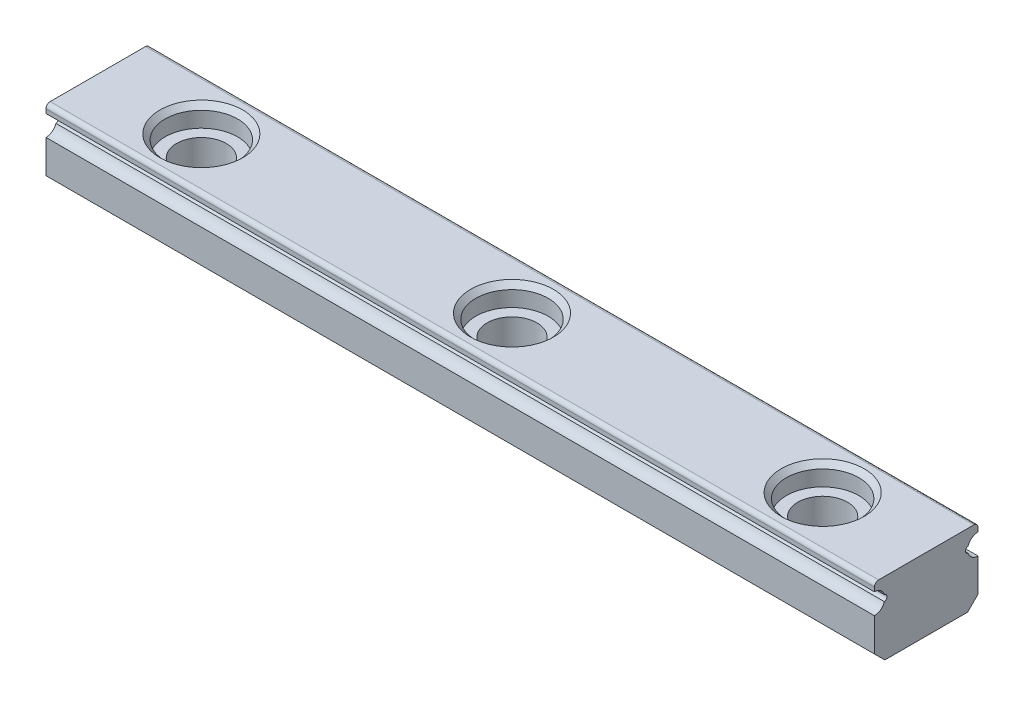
ISO-10303-21;
HEADER;
FILE_DESCRIPTION(('STEP AP214'),'2;1');
FILE_NAME('part.step','',(''),(''),'','','');
FILE_SCHEMA(('AUTOMOTIVE_DESIGN { 1 0 10303 214 1 1 1 1 }'));
ENDSEC;
DATA;
#1=APPLICATION_CONTEXT('core data for automotive mechanical design processes');
#2=APPLICATION_PROTOCOL_DEFINITION('international standard','automotive_design',2000,#1);
#3=PRODUCT_CONTEXT('',#1,'mechanical');
#4=PRODUCT('Part','Part','',(#3));
#5=PRODUCT_RELATED_PRODUCT_CATEGORY('part','',(#4));
#6=PRODUCT_DEFINITION_FORMATION('','',#4);
#7=PRODUCT_DEFINITION_CONTEXT('part definition',#1,'design');
#8=PRODUCT_DEFINITION('design','',#6,#7);
#9=PRODUCT_DEFINITION_SHAPE('','',#8);
#10=(LENGTH_UNIT() NAMED_UNIT(*) SI_UNIT(.MILLI.,.METRE.));
#11=(NAMED_UNIT(*) PLANE_ANGLE_UNIT() SI_UNIT($,.RADIAN.));
#12=(NAMED_UNIT(*) SI_UNIT($,.STERADIAN.) SOLID_ANGLE_UNIT());
#13=UNCERTAINTY_MEASURE_WITH_UNIT(LENGTH_MEASURE(1.E-05),#10,'distance_accuracy_value','');
#14=(GEOMETRIC_REPRESENTATION_CONTEXT(3) GLOBAL_UNCERTAINTY_ASSIGNED_CONTEXT((#13)) GLOBAL_UNIT_ASSIGNED_CONTEXT((#10,
#11,#12)) REPRESENTATION_CONTEXT('',''));
#15=CARTESIAN_POINT('',(0.,0.,0.));
#16=DIRECTION('',(0.,0.,1.));
#17=DIRECTION('',(1.,0.,0.));
#18=AXIS2_PLACEMENT_3D('',#15,#16,#17);
#19=CARTESIAN_POINT('',(-40.,0.499999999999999,2.5));
#20=DIRECTION('',(0.,0.,1.));
#21=DIRECTION('',(0.,-1.,0.));
#22=AXIS2_PLACEMENT_3D('',#19,#20,#21);
#23=PLANE('',#22);
#24=DIRECTION('',(1.,0.,0.));
#25=VECTOR('',#24,1.);
#26=CARTESIAN_POINT('',(-40.,2.09999999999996,2.5));
#27=LINE('',#26,#25);
#28=CARTESIAN_POINT('',(-40.,2.09999999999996,2.5));
#29=VERTEX_POINT('',#28);
#30=CARTESIAN_POINT('',(0.,2.09999999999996,2.5));
#31=VERTEX_POINT('',#30);
#32=EDGE_CURVE('E180',#29,#31,#27,.T.);
#33=ORIENTED_EDGE('',*,*,#32,.F.);
#34=DIRECTION('',(0.,-1.,0.));
#35=VECTOR('',#34,1.);
#36=CARTESIAN_POINT('',(-40.,0.499999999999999,2.5));
#37=LINE('',#36,#35);
#38=CARTESIAN_POINT('',(-40.,0.499999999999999,2.5));
#39=VERTEX_POINT('',#38);
#40=EDGE_CURVE('E168',#29,#39,#37,.T.);
#41=ORIENTED_EDGE('',*,*,#40,.T.);
#42=DIRECTION('',(1.,0.,0.));
#43=VECTOR('',#42,1.);
#44=CARTESIAN_POINT('',(-40.,0.499999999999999,2.5));
#45=LINE('',#44,#43);
#46=CARTESIAN_POINT('',(0.,0.499999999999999,2.5));
#47=VERTEX_POINT('',#46);
#48=EDGE_CURVE('E274',#39,#47,#45,.T.);
#49=ORIENTED_EDGE('',*,*,#48,.T.);
#50=DIRECTION('',(0.,-1.,0.));
#51=VECTOR('',#50,1.);
#52=CARTESIAN_POINT('',(0.,0.499999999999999,2.5));
#53=LINE('',#52,#51);
#54=EDGE_CURVE('E256',#31,#47,#53,.T.);
#55=ORIENTED_EDGE('',*,*,#54,.F.);
#56=EDGE_LOOP('',(#33,#41,#49,#55));
#57=FACE_BOUND('',#56,.T.);
#58=ADVANCED_FACE('F33',(#57),#23,.T.);
#59=CARTESIAN_POINT('',(-40.,0.5,-2.5));
#60=DIRECTION('',(0.,0.,-1.));
#61=DIRECTION('',(0.,1.,0.));
#62=AXIS2_PLACEMENT_3D('',#59,#60,#61);
#63=PLANE('',#62);
#64=DIRECTION('',(0.,1.,0.));
#65=VECTOR('',#64,1.);
#66=CARTESIAN_POINT('',(-40.,0.5,-2.5));
#67=LINE('',#66,#65);
#68=CARTESIAN_POINT('',(-40.,3.09999999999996,-2.5));
#69=VERTEX_POINT('',#68);
#70=CARTESIAN_POINT('',(-40.,3.3,-2.5));
#71=VERTEX_POINT('',#70);
#72=EDGE_CURVE('E268',#69,#71,#67,.T.);
#73=ORIENTED_EDGE('',*,*,#72,.T.);
#74=DIRECTION('',(1.,0.,0.));
#75=VECTOR('',#74,1.);
#76=CARTESIAN_POINT('',(-40.,3.3,-2.5));
#77=LINE('',#76,#75);
#78=CARTESIAN_POINT('',(0.,3.3,-2.5));
#79=VERTEX_POINT('',#78);
#80=EDGE_CURVE('E305',#71,#79,#77,.T.);
#81=ORIENTED_EDGE('',*,*,#80,.T.);
#82=DIRECTION('',(0.,1.,0.));
#83=VECTOR('',#82,1.);
#84=CARTESIAN_POINT('',(0.,0.5,-2.5));
#85=LINE('',#84,#83);
#86=CARTESIAN_POINT('',(0.,3.09999999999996,-2.5));
#87=VERTEX_POINT('',#86);
#88=EDGE_CURVE('E286',#87,#79,#85,.T.);
#89=ORIENTED_EDGE('',*,*,#88,.F.);
#90=DIRECTION('',(1.,0.,0.));
#91=VECTOR('',#90,1.);
#92=CARTESIAN_POINT('',(-40.,3.09999999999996,-2.5));
#93=LINE('',#92,#91);
#94=EDGE_CURVE('E200',#69,#87,#93,.T.);
#95=ORIENTED_EDGE('',*,*,#94,.F.);
#96=EDGE_LOOP('',(#73,#81,#89,#95));
#97=FACE_BOUND('',#96,.T.);
#98=ADVANCED_FACE('F326',(#97),#63,.T.);
#99=CARTESIAN_POINT('',(0.,3.3,2.5));
#100=VERTEX_POINT('',#99);
#101=CARTESIAN_POINT('',(0.,3.09999999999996,2.5));
#102=VERTEX_POINT('',#101);
#103=EDGE_CURVE('E275',#100,#102,#53,.T.);
#104=ORIENTED_EDGE('',*,*,#103,.F.);
#105=DIRECTION('',(1.,0.,0.));
#106=VECTOR('',#105,1.);
#107=CARTESIAN_POINT('',(-40.,3.3,2.5));
#108=LINE('',#107,#106);
#109=CARTESIAN_POINT('',(-40.,3.3,2.5));
#110=VERTEX_POINT('',#109);
#111=EDGE_CURVE('E11',#100,#110,#108,.F.);
#112=ORIENTED_EDGE('',*,*,#111,.T.);
#113=CARTESIAN_POINT('',(-40.,3.09999999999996,2.5));
#114=VERTEX_POINT('',#113);
#115=EDGE_CURVE('E257',#110,#114,#37,.T.);
#116=ORIENTED_EDGE('',*,*,#115,.T.);
#117=DIRECTION('',(1.,0.,0.));
#118=VECTOR('',#117,1.);
#119=CARTESIAN_POINT('',(-40.,3.09999999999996,2.5));
#120=LINE('',#119,#118);
#121=EDGE_CURVE('E176',#102,#114,#120,.F.);
#122=ORIENTED_EDGE('',*,*,#121,.F.);
#123=EDGE_LOOP('',(#104,#112,#116,#122));
#124=FACE_BOUND('',#123,.T.);
#125=ADVANCED_FACE('F340',(#124),#23,.T.);
#126=CARTESIAN_POINT('',(-40.,3.5,-2.5));
#127=DIRECTION('',(0.,1.,0.));
#128=DIRECTION('',(0.,0.,1.));
#129=AXIS2_PLACEMENT_3D('',#126,#127,#128);
#130=PLANE('',#129);
#131=CARTESIAN_POINT('',(-35.,3.5,0.));
#132=DIRECTION('',(0.,1.,0.));
#133=DIRECTION('',(0.,0.,1.));
#134=AXIS2_PLACEMENT_3D('',#131,#132,#133);
#135=CIRCLE('',#134,2.);
#136=CARTESIAN_POINT('',(-35.,3.5,2.));
#137=VERTEX_POINT('',#136);
#138=EDGE_CURVE('E202',#137,#137,#135,.T.);
#139=ORIENTED_EDGE('',*,*,#138,.F.);
#140=EDGE_LOOP('',(#139));
#141=FACE_BOUND('',#140,.T.);
#142=CARTESIAN_POINT('',(-20.,3.5,0.));
#143=DIRECTION('',(0.,1.,0.));
#144=DIRECTION('',(0.,0.,1.));
#145=AXIS2_PLACEMENT_3D('',#142,#143,#144);
#146=CIRCLE('',#145,2.);
#147=CARTESIAN_POINT('',(-20.,3.5,2.));
#148=VERTEX_POINT('',#147);
#149=EDGE_CURVE('E220',#148,#148,#146,.T.);
#150=ORIENTED_EDGE('',*,*,#149,.F.);
#151=EDGE_LOOP('',(#150));
#152=FACE_BOUND('',#151,.T.);
#153=CARTESIAN_POINT('',(-5.,3.5,0.));
#154=DIRECTION('',(0.,1.,0.));
#155=DIRECTION('',(0.,0.,1.));
#156=AXIS2_PLACEMENT_3D('',#153,#154,#155);
#157=CIRCLE('',#156,2.);
#158=CARTESIAN_POINT('',(-5.,3.5,2.));
#159=VERTEX_POINT('',#158);
#160=EDGE_CURVE('E238',#159,#159,#157,.T.);
#161=ORIENTED_EDGE('',*,*,#160,.F.);
#162=EDGE_LOOP('',(#161));
#163=FACE_BOUND('',#162,.T.);
#164=DIRECTION('',(0.,0.,1.));
#165=VECTOR('',#164,1.);
#166=CARTESIAN_POINT('',(0.,3.5,-2.5));
#167=LINE('',#166,#165);
#168=CARTESIAN_POINT('',(0.,3.5,-2.3));
#169=VERTEX_POINT('',#168);
#170=CARTESIAN_POINT('',(0.,3.5,2.3));
#171=VERTEX_POINT('',#170);
#172=EDGE_CURVE('E290',#169,#171,#167,.T.);
#173=ORIENTED_EDGE('',*,*,#172,.F.);
#174=DIRECTION('',(1.,0.,0.));
#175=VECTOR('',#174,1.);
#176=CARTESIAN_POINT('',(-40.,3.5,-2.3));
#177=LINE('',#176,#175);
#178=CARTESIAN_POINT('',(-40.,3.5,-2.3));
#179=VERTEX_POINT('',#178);
#180=EDGE_CURVE('E315',#169,#179,#177,.F.);
#181=ORIENTED_EDGE('',*,*,#180,.T.);
#182=DIRECTION('',(0.,0.,1.));
#183=VECTOR('',#182,1.);
#184=CARTESIAN_POINT('',(-40.,3.5,-2.5));
#185=LINE('',#184,#183);
#186=CARTESIAN_POINT('',(-40.,3.5,2.3));
#187=VERTEX_POINT('',#186);
#188=EDGE_CURVE('E272',#179,#187,#185,.T.);
#189=ORIENTED_EDGE('',*,*,#188,.T.);
#190=DIRECTION('',(1.,0.,0.));
#191=VECTOR('',#190,1.);
#192=CARTESIAN_POINT('',(-40.,3.5,2.3));
#193=LINE('',#192,#191);
#194=EDGE_CURVE('E312',#187,#171,#193,.T.);
#195=ORIENTED_EDGE('',*,*,#194,.T.);
#196=EDGE_LOOP('',(#173,#181,#189,#195));
#197=FACE_BOUND('',#196,.T.);
#198=ADVANCED_FACE('F335',(#141,#152,#163,#197),#130,.T.);
#199=DIRECTION('',(1.,0.,0.));
#200=VECTOR('',#199,1.);
#201=CARTESIAN_POINT('',(-40.,2.09999999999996,-2.5));
#202=LINE('',#201,#200);
#203=CARTESIAN_POINT('',(0.,2.09999999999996,-2.5));
#204=VERTEX_POINT('',#203);
#205=CARTESIAN_POINT('',(-40.,2.09999999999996,-2.5));
#206=VERTEX_POINT('',#205);
#207=EDGE_CURVE('E197',#204,#206,#202,.F.);
#208=ORIENTED_EDGE('',*,*,#207,.F.);
#209=CARTESIAN_POINT('',(0.,0.5,-2.5));
#210=VERTEX_POINT('',#209);
#211=EDGE_CURVE('E287',#210,#204,#85,.T.);
#212=ORIENTED_EDGE('',*,*,#211,.F.);
#213=DIRECTION('',(1.,0.,0.));
#214=VECTOR('',#213,1.);
#215=CARTESIAN_POINT('',(-40.,0.5,-2.5));
#216=LINE('',#215,#214);
#217=CARTESIAN_POINT('',(-40.,0.5,-2.5));
#218=VERTEX_POINT('',#217);
#219=EDGE_CURVE('E293',#218,#210,#216,.T.);
#220=ORIENTED_EDGE('',*,*,#219,.F.);
#221=EDGE_CURVE('E269',#218,#206,#67,.T.);
#222=ORIENTED_EDGE('',*,*,#221,.T.);
#223=EDGE_LOOP('',(#208,#212,#220,#222));
#224=FACE_BOUND('',#223,.T.);
#225=ADVANCED_FACE('F361',(#224),#63,.T.);
#226=CARTESIAN_POINT('',(-40.,0.,-2.));
#227=DIRECTION('',(0.,-0.707106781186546,-0.707106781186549));
#228=DIRECTION('',(0.,0.707106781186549,-0.707106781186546));
#229=AXIS2_PLACEMENT_3D('',#226,#227,#228);
#230=PLANE('',#229);
#231=DIRECTION('',(0.,0.707106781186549,-0.707106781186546));
#232=VECTOR('',#231,1.);
#233=CARTESIAN_POINT('',(0.,0.,-2.));
#234=LINE('',#233,#232);
#235=CARTESIAN_POINT('',(0.,0.,-2.));
#236=VERTEX_POINT('',#235);
#237=EDGE_CURVE('E283',#236,#210,#234,.T.);
#238=ORIENTED_EDGE('',*,*,#237,.F.);
#239=DIRECTION('',(1.,0.,0.));
#240=VECTOR('',#239,1.);
#241=CARTESIAN_POINT('',(-40.,0.,-2.));
#242=LINE('',#241,#240);
#243=CARTESIAN_POINT('',(-40.,0.,-2.));
#244=VERTEX_POINT('',#243);
#245=EDGE_CURVE('E296',#244,#236,#242,.T.);
#246=ORIENTED_EDGE('',*,*,#245,.F.);
#247=DIRECTION('',(0.,0.707106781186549,-0.707106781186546));
#248=VECTOR('',#247,1.);
#249=CARTESIAN_POINT('',(-40.,0.,-2.));
#250=LINE('',#249,#248);
#251=EDGE_CURVE('E265',#244,#218,#250,.T.);
#252=ORIENTED_EDGE('',*,*,#251,.T.);
#253=ORIENTED_EDGE('',*,*,#219,.T.);
#254=EDGE_LOOP('',(#238,#246,#252,#253));
#255=FACE_BOUND('',#254,.T.);
#256=ADVANCED_FACE('F356',(#255),#230,.T.);
#257=CARTESIAN_POINT('',(-40.,0.,-2.));
#258=DIRECTION('',(0.,-1.,0.));
#259=DIRECTION('',(0.,0.,-1.));
#260=AXIS2_PLACEMENT_3D('',#257,#258,#259);
#261=PLANE('',#260);
#262=CARTESIAN_POINT('',(-35.,0.,0.));
#263=DIRECTION('',(0.,1.,0.));
#264=DIRECTION('',(0.,0.,1.));
#265=AXIS2_PLACEMENT_3D('',#262,#263,#264);
#266=CIRCLE('',#265,1.4);
#267=CARTESIAN_POINT('',(-35.,0.,1.4));
#268=VERTEX_POINT('',#267);
#269=EDGE_CURVE('E217',#268,#268,#266,.T.);
#270=ORIENTED_EDGE('',*,*,#269,.T.);
#271=EDGE_LOOP('',(#270));
#272=FACE_BOUND('',#271,.T.);
#273=CARTESIAN_POINT('',(-20.,0.,0.));
#274=DIRECTION('',(0.,1.,0.));
#275=DIRECTION('',(0.,0.,1.));
#276=AXIS2_PLACEMENT_3D('',#273,#274,#275);
#277=CIRCLE('',#276,1.4);
#278=CARTESIAN_POINT('',(-20.,0.,1.4));
#279=VERTEX_POINT('',#278);
#280=EDGE_CURVE('E235',#279,#279,#277,.T.);
#281=ORIENTED_EDGE('',*,*,#280,.T.);
#282=EDGE_LOOP('',(#281));
#283=FACE_BOUND('',#282,.T.);
#284=CARTESIAN_POINT('',(-5.,0.,0.));
#285=DIRECTION('',(0.,1.,0.));
#286=DIRECTION('',(0.,0.,1.));
#287=AXIS2_PLACEMENT_3D('',#284,#285,#286);
#288=CIRCLE('',#287,1.4);
#289=CARTESIAN_POINT('',(-5.,0.,1.4));
#290=VERTEX_POINT('',#289);
#291=EDGE_CURVE('E253',#290,#290,#288,.T.);
#292=ORIENTED_EDGE('',*,*,#291,.T.);
#293=EDGE_LOOP('',(#292));
#294=FACE_BOUND('',#293,.T.);
#295=DIRECTION('',(0.,0.,-1.));
#296=VECTOR('',#295,1.);
#297=CARTESIAN_POINT('',(0.,0.,-2.));
#298=LINE('',#297,#296);
#299=CARTESIAN_POINT('',(0.,0.,2.));
#300=VERTEX_POINT('',#299);
#301=EDGE_CURVE('E280',#300,#236,#298,.T.);
#302=ORIENTED_EDGE('',*,*,#301,.F.);
#303=DIRECTION('',(1.,0.,0.));
#304=VECTOR('',#303,1.);
#305=CARTESIAN_POINT('',(-40.,0.,2.));
#306=LINE('',#305,#304);
#307=CARTESIAN_POINT('',(-40.,0.,2.));
#308=VERTEX_POINT('',#307);
#309=EDGE_CURVE('E298',#308,#300,#306,.T.);
#310=ORIENTED_EDGE('',*,*,#309,.F.);
#311=DIRECTION('',(0.,0.,-1.));
#312=VECTOR('',#311,1.);
#313=CARTESIAN_POINT('',(-40.,0.,-2.));
#314=LINE('',#313,#312);
#315=EDGE_CURVE('E262',#308,#244,#314,.T.);
#316=ORIENTED_EDGE('',*,*,#315,.T.);
#317=ORIENTED_EDGE('',*,*,#245,.T.);
#318=EDGE_LOOP('',(#302,#310,#316,#317));
#319=FACE_BOUND('',#318,.T.);
#320=ADVANCED_FACE('F352',(#272,#283,#294,#319),#261,.T.);
#321=CARTESIAN_POINT('',(-40.,0.,2.));
#322=DIRECTION('',(0.,-0.707106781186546,0.707106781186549));
#323=DIRECTION('',(0.,-0.707106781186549,-0.707106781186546));
#324=AXIS2_PLACEMENT_3D('',#321,#322,#323);
#325=PLANE('',#324);
#326=DIRECTION('',(0.,-0.707106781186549,-0.707106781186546));
#327=VECTOR('',#326,1.);
#328=CARTESIAN_POINT('',(0.,0.,2.));
#329=LINE('',#328,#327);
#330=EDGE_CURVE('E277',#47,#300,#329,.T.);
#331=ORIENTED_EDGE('',*,*,#330,.F.);
#332=ORIENTED_EDGE('',*,*,#48,.F.);
#333=DIRECTION('',(0.,-0.707106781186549,-0.707106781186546));
#334=VECTOR('',#333,1.);
#335=CARTESIAN_POINT('',(-40.,0.,2.));
#336=LINE('',#335,#334);
#337=EDGE_CURVE('E259',#39,#308,#336,.T.);
#338=ORIENTED_EDGE('',*,*,#337,.T.);
#339=ORIENTED_EDGE('',*,*,#309,.T.);
#340=EDGE_LOOP('',(#331,#332,#338,#339));
#341=FACE_BOUND('',#340,.T.);
#342=ADVANCED_FACE('F348',(#341),#325,.T.);
#343=CARTESIAN_POINT('',(-40.,3.5,2.5));
#344=DIRECTION('',(1.,0.,0.));
#345=DIRECTION('',(0.,0.,-1.));
#346=AXIS2_PLACEMENT_3D('',#343,#344,#345);
#347=PLANE('',#346);
#348=ORIENTED_EDGE('',*,*,#188,.F.);
#349=CARTESIAN_POINT('',(-40.,3.3,-2.3));
#350=DIRECTION('',(1.,0.,0.));
#351=DIRECTION('',(0.,0.,-1.));
#352=AXIS2_PLACEMENT_3D('',#349,#350,#351);
#353=CIRCLE('',#352,0.2);
#354=EDGE_CURVE('E41',#179,#71,#353,.F.);
#355=ORIENTED_EDGE('',*,*,#354,.T.);
#356=ORIENTED_EDGE('',*,*,#72,.F.);
#357=CARTESIAN_POINT('',(-40.,2.59999999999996,-2.5));
#358=DIRECTION('',(1.,0.,0.));
#359=DIRECTION('',(0.,0.,-1.));
#360=AXIS2_PLACEMENT_3D('',#357,#358,#359);
#361=CIRCLE('',#360,0.5);
#362=CARTESIAN_POINT('',(-40.,2.74825255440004,-2.02248436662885));
#363=VERTEX_POINT('',#362);
#364=EDGE_CURVE('E187',#69,#363,#361,.T.);
#365=ORIENTED_EDGE('',*,*,#364,.T.);
#366=CARTESIAN_POINT('',(-40.,2.59999999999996,-2.04531373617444));
#367=DIRECTION('',(1.,0.,0.));
#368=DIRECTION('',(0.,0.,-1.));
#369=AXIS2_PLACEMENT_3D('',#366,#367,#368);
#370=CIRCLE('',#369,0.15);
#371=CARTESIAN_POINT('',(-40.,2.45174744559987,-2.02248436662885));
#372=VERTEX_POINT('',#371);
#373=EDGE_CURVE('E186',#363,#372,#370,.T.);
#374=ORIENTED_EDGE('',*,*,#373,.T.);
#375=EDGE_CURVE('E183',#372,#206,#361,.T.);
#376=ORIENTED_EDGE('',*,*,#375,.T.);
#377=ORIENTED_EDGE('',*,*,#221,.F.);
#378=ORIENTED_EDGE('',*,*,#251,.F.);
#379=ORIENTED_EDGE('',*,*,#315,.F.);
#380=ORIENTED_EDGE('',*,*,#337,.F.);
#381=ORIENTED_EDGE('',*,*,#40,.F.);
#382=CARTESIAN_POINT('',(-40.,2.59999999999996,2.5));
#383=DIRECTION('',(1.,0.,0.));
#384=DIRECTION('',(0.,0.,1.));
#385=AXIS2_PLACEMENT_3D('',#382,#383,#384);
#386=CIRCLE('',#385,0.5);
#387=CARTESIAN_POINT('',(-40.,2.45174744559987,2.02248436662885));
#388=VERTEX_POINT('',#387);
#389=EDGE_CURVE('E149',#29,#388,#386,.T.);
#390=ORIENTED_EDGE('',*,*,#389,.T.);
#391=CARTESIAN_POINT('',(-40.,2.59999999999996,2.04531373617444));
#392=DIRECTION('',(1.,0.,0.));
#393=DIRECTION('',(0.,0.,1.));
#394=AXIS2_PLACEMENT_3D('',#391,#392,#393);
#395=CIRCLE('',#394,0.15);
#396=CARTESIAN_POINT('',(-40.,2.74825255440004,2.02248436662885));
#397=VERTEX_POINT('',#396);
#398=EDGE_CURVE('E157',#388,#397,#395,.T.);
#399=ORIENTED_EDGE('',*,*,#398,.T.);
#400=EDGE_CURVE('E163',#397,#114,#386,.T.);
#401=ORIENTED_EDGE('',*,*,#400,.T.);
#402=ORIENTED_EDGE('',*,*,#115,.F.);
#403=CARTESIAN_POINT('',(-40.,3.3,2.3));
#404=DIRECTION('',(1.,0.,0.));
#405=DIRECTION('',(0.,0.,-1.));
#406=AXIS2_PLACEMENT_3D('',#403,#404,#405);
#407=CIRCLE('',#406,0.2);
#408=EDGE_CURVE('E53',#110,#187,#407,.F.);
#409=ORIENTED_EDGE('',*,*,#408,.T.);
#410=EDGE_LOOP('',(#348,#355,#356,#365,#374,#376,#377,#378,#379,#380,#381,#390,#399,#401,#402,#409));
#411=FACE_BOUND('',#410,.T.);
#412=ADVANCED_FACE('F166',(#411),#347,.F.);
#413=CARTESIAN_POINT('',(0.,3.5,2.5));
#414=DIRECTION('',(1.,0.,0.));
#415=DIRECTION('',(0.,0.,-1.));
#416=AXIS2_PLACEMENT_3D('',#413,#414,#415);
#417=PLANE('',#416);
#418=ORIENTED_EDGE('',*,*,#88,.T.);
#419=CARTESIAN_POINT('',(0.,3.3,-2.3));
#420=DIRECTION('',(1.,0.,0.));
#421=DIRECTION('',(0.,0.,-1.));
#422=AXIS2_PLACEMENT_3D('',#419,#420,#421);
#423=CIRCLE('',#422,0.2);
#424=EDGE_CURVE('E310',#79,#169,#423,.T.);
#425=ORIENTED_EDGE('',*,*,#424,.T.);
#426=ORIENTED_EDGE('',*,*,#172,.T.);
#427=CARTESIAN_POINT('',(0.,3.3,2.3));
#428=DIRECTION('',(1.,0.,0.));
#429=DIRECTION('',(0.,0.,-1.));
#430=AXIS2_PLACEMENT_3D('',#427,#428,#429);
#431=CIRCLE('',#430,0.2);
#432=EDGE_CURVE('E308',#171,#100,#431,.T.);
#433=ORIENTED_EDGE('',*,*,#432,.T.);
#434=ORIENTED_EDGE('',*,*,#103,.T.);
#435=CARTESIAN_POINT('',(0.,2.59999999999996,2.5));
#436=DIRECTION('',(1.,0.,0.));
#437=DIRECTION('',(0.,0.,1.));
#438=AXIS2_PLACEMENT_3D('',#435,#436,#437);
#439=CIRCLE('',#438,0.5);
#440=CARTESIAN_POINT('',(0.,2.74825255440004,2.02248436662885));
#441=VERTEX_POINT('',#440);
#442=EDGE_CURVE('E171',#441,#102,#439,.T.);
#443=ORIENTED_EDGE('',*,*,#442,.F.);
#444=CARTESIAN_POINT('',(0.,2.59999999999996,2.04531373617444));
#445=DIRECTION('',(1.,0.,0.));
#446=DIRECTION('',(0.,0.,1.));
#447=AXIS2_PLACEMENT_3D('',#444,#445,#446);
#448=CIRCLE('',#447,0.15);
#449=CARTESIAN_POINT('',(0.,2.45174744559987,2.02248436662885));
#450=VERTEX_POINT('',#449);
#451=EDGE_CURVE('E169',#450,#441,#448,.T.);
#452=ORIENTED_EDGE('',*,*,#451,.F.);
#453=CARTESIAN_POINT('',(0.,2.59999999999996,2.5));
#454=DIRECTION('',(1.,0.,0.));
#455=DIRECTION('',(0.,0.,-1.));
#456=AXIS2_PLACEMENT_3D('',#453,#454,#455);
#457=CIRCLE('',#456,0.5);
#458=EDGE_CURVE('E152',#31,#450,#457,.T.);
#459=ORIENTED_EDGE('',*,*,#458,.F.);
#460=ORIENTED_EDGE('',*,*,#54,.T.);
#461=ORIENTED_EDGE('',*,*,#330,.T.);
#462=ORIENTED_EDGE('',*,*,#301,.T.);
#463=ORIENTED_EDGE('',*,*,#237,.T.);
#464=ORIENTED_EDGE('',*,*,#211,.T.);
#465=CARTESIAN_POINT('',(0.,2.59999999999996,-2.5));
#466=DIRECTION('',(1.,0.,0.));
#467=DIRECTION('',(0.,0.,-1.));
#468=AXIS2_PLACEMENT_3D('',#465,#466,#467);
#469=CIRCLE('',#468,0.5);
#470=CARTESIAN_POINT('',(0.,2.45174744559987,-2.02248436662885));
#471=VERTEX_POINT('',#470);
#472=EDGE_CURVE('E182',#471,#204,#469,.T.);
#473=ORIENTED_EDGE('',*,*,#472,.F.);
#474=CARTESIAN_POINT('',(0.,2.59999999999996,-2.04531373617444));
#475=DIRECTION('',(1.,0.,0.));
#476=DIRECTION('',(0.,0.,-1.));
#477=AXIS2_PLACEMENT_3D('',#474,#475,#476);
#478=CIRCLE('',#477,0.15);
#479=CARTESIAN_POINT('',(0.,2.74825255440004,-2.02248436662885));
#480=VERTEX_POINT('',#479);
#481=EDGE_CURVE('E192',#480,#471,#478,.T.);
#482=ORIENTED_EDGE('',*,*,#481,.F.);
#483=CARTESIAN_POINT('',(0.,2.59999999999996,-2.5));
#484=DIRECTION('',(1.,0.,0.));
#485=DIRECTION('',(0.,0.,-1.));
#486=AXIS2_PLACEMENT_3D('',#483,#484,#485);
#487=CIRCLE('',#486,0.5);
#488=EDGE_CURVE('E295',#87,#480,#487,.T.);
#489=ORIENTED_EDGE('',*,*,#488,.F.);
#490=EDGE_LOOP('',(#418,#425,#426,#433,#434,#443,#452,#459,#460,#461,#462,#463,#464,#473,#482,#489));
#491=FACE_BOUND('',#490,.T.);
#492=ADVANCED_FACE('F332',(#491),#417,.T.);
#493=CARTESIAN_POINT('',(-5.,0.2,0.));
#494=DIRECTION('',(0.,-1.,0.));
#495=DIRECTION('',(0.,0.,-1.));
#496=AXIS2_PLACEMENT_3D('',#493,#494,#495);
#497=CONICAL_SURFACE('',#496,1.2,0.785398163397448);
#498=ORIENTED_EDGE('',*,*,#291,.F.);
#499=EDGE_LOOP('',(#498));
#500=FACE_BOUND('',#499,.T.);
#501=CARTESIAN_POINT('',(-5.,0.2,0.));
#502=DIRECTION('',(0.,1.,0.));
#503=DIRECTION('',(0.,0.,1.));
#504=AXIS2_PLACEMENT_3D('',#501,#502,#503);
#505=CIRCLE('',#504,1.2);
#506=CARTESIAN_POINT('',(-5.,0.2,1.2));
#507=VERTEX_POINT('',#506);
#508=EDGE_CURVE('E250',#507,#507,#505,.T.);
#509=ORIENTED_EDGE('',*,*,#508,.T.);
#510=EDGE_LOOP('',(#509));
#511=FACE_BOUND('',#510,.T.);
#512=ADVANCED_FACE('F415',(#500,#511),#497,.F.);
#513=CARTESIAN_POINT('',(-5.,3.5,0.));
#514=DIRECTION('',(0.,1.,0.));
#515=DIRECTION('',(0.,0.,1.));
#516=AXIS2_PLACEMENT_3D('',#513,#514,#515);
#517=CYLINDRICAL_SURFACE('',#516,1.2);
#518=ORIENTED_EDGE('',*,*,#508,.F.);
#519=EDGE_LOOP('',(#518));
#520=FACE_BOUND('',#519,.T.);
#521=CARTESIAN_POINT('',(-5.,2.5,0.));
#522=DIRECTION('',(0.,1.,0.));
#523=DIRECTION('',(0.,0.,1.));
#524=AXIS2_PLACEMENT_3D('',#521,#522,#523);
#525=CIRCLE('',#524,1.2);
#526=CARTESIAN_POINT('',(-5.,2.5,1.2));
#527=VERTEX_POINT('',#526);
#528=EDGE_CURVE('E247',#527,#527,#525,.T.);
#529=ORIENTED_EDGE('',*,*,#528,.T.);
#530=EDGE_LOOP('',(#529));
#531=FACE_BOUND('',#530,.T.);
#532=ADVANCED_FACE('F419',(#520,#531),#517,.F.);
#533=CARTESIAN_POINT('',(-3.25,2.5,0.));
#534=DIRECTION('',(0.,-1.,0.));
#535=DIRECTION('',(0.,0.,-1.));
#536=AXIS2_PLACEMENT_3D('',#533,#534,#535);
#537=PLANE('',#536);
#538=ORIENTED_EDGE('',*,*,#528,.F.);
#539=EDGE_LOOP('',(#538));
#540=FACE_BOUND('',#539,.T.);
#541=CARTESIAN_POINT('',(-5.,2.5,0.));
#542=DIRECTION('',(0.,1.,0.));
#543=DIRECTION('',(0.,0.,1.));
#544=AXIS2_PLACEMENT_3D('',#541,#542,#543);
#545=CIRCLE('',#544,1.75);
#546=CARTESIAN_POINT('',(-5.,2.5,1.75));
#547=VERTEX_POINT('',#546);
#548=EDGE_CURVE('E244',#547,#547,#545,.T.);
#549=ORIENTED_EDGE('',*,*,#548,.T.);
#550=EDGE_LOOP('',(#549));
#551=FACE_BOUND('',#550,.T.);
#552=ADVANCED_FACE('F423',(#540,#551),#537,.F.);
#553=CARTESIAN_POINT('',(-5.,3.5,0.));
#554=DIRECTION('',(0.,1.,0.));
#555=DIRECTION('',(0.,0.,1.));
#556=AXIS2_PLACEMENT_3D('',#553,#554,#555);
#557=CYLINDRICAL_SURFACE('',#556,1.75);
#558=ORIENTED_EDGE('',*,*,#548,.F.);
#559=EDGE_LOOP('',(#558));
#560=FACE_BOUND('',#559,.T.);
#561=CARTESIAN_POINT('',(-5.,3.25,0.));
#562=DIRECTION('',(0.,1.,0.));
#563=DIRECTION('',(0.,0.,1.));
#564=AXIS2_PLACEMENT_3D('',#561,#562,#563);
#565=CIRCLE('',#564,1.75);
#566=CARTESIAN_POINT('',(-5.,3.25,1.75));
#567=VERTEX_POINT('',#566);
#568=EDGE_CURVE('E241',#567,#567,#565,.T.);
#569=ORIENTED_EDGE('',*,*,#568,.T.);
#570=EDGE_LOOP('',(#569));
#571=FACE_BOUND('',#570,.T.);
#572=ADVANCED_FACE('F427',(#560,#571),#557,.F.);
#573=CARTESIAN_POINT('',(-5.,3.5,0.));
#574=DIRECTION('',(0.,1.,0.));
#575=DIRECTION('',(0.,0.,1.));
#576=AXIS2_PLACEMENT_3D('',#573,#574,#575);
#577=CONICAL_SURFACE('',#576,2.,0.785398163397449);
#578=ORIENTED_EDGE('',*,*,#568,.F.);
#579=EDGE_LOOP('',(#578));
#580=FACE_BOUND('',#579,.T.);
#581=ORIENTED_EDGE('',*,*,#160,.T.);
#582=EDGE_LOOP('',(#581));
#583=FACE_BOUND('',#582,.T.);
#584=ADVANCED_FACE('F431',(#580,#583),#577,.F.);
#585=CARTESIAN_POINT('',(-20.,0.2,0.));
#586=DIRECTION('',(0.,-1.,0.));
#587=DIRECTION('',(0.,0.,-1.));
#588=AXIS2_PLACEMENT_3D('',#585,#586,#587);
#589=CONICAL_SURFACE('',#588,1.2,0.785398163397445);
#590=ORIENTED_EDGE('',*,*,#280,.F.);
#591=EDGE_LOOP('',(#590));
#592=FACE_BOUND('',#591,.T.);
#593=CARTESIAN_POINT('',(-20.,0.2,0.));
#594=DIRECTION('',(0.,1.,0.));
#595=DIRECTION('',(0.,0.,1.));
#596=AXIS2_PLACEMENT_3D('',#593,#594,#595);
#597=CIRCLE('',#596,1.2);
#598=CARTESIAN_POINT('',(-20.,0.2,1.2));
#599=VERTEX_POINT('',#598);
#600=EDGE_CURVE('E232',#599,#599,#597,.T.);
#601=ORIENTED_EDGE('',*,*,#600,.T.);
#602=EDGE_LOOP('',(#601));
#603=FACE_BOUND('',#602,.T.);
#604=ADVANCED_FACE('F435',(#592,#603),#589,.F.);
#605=CARTESIAN_POINT('',(-20.,3.5,0.));
#606=DIRECTION('',(0.,1.,0.));
#607=DIRECTION('',(0.,0.,1.));
#608=AXIS2_PLACEMENT_3D('',#605,#606,#607);
#609=CYLINDRICAL_SURFACE('',#608,1.2);
#610=ORIENTED_EDGE('',*,*,#600,.F.);
#611=EDGE_LOOP('',(#610));
#612=FACE_BOUND('',#611,.T.);
#613=CARTESIAN_POINT('',(-20.,2.5,0.));
#614=DIRECTION('',(0.,1.,0.));
#615=DIRECTION('',(0.,0.,1.));
#616=AXIS2_PLACEMENT_3D('',#613,#614,#615);
#617=CIRCLE('',#616,1.2);
#618=CARTESIAN_POINT('',(-20.,2.5,1.2));
#619=VERTEX_POINT('',#618);
#620=EDGE_CURVE('E229',#619,#619,#617,.T.);
#621=ORIENTED_EDGE('',*,*,#620,.T.);
#622=EDGE_LOOP('',(#621));
#623=FACE_BOUND('',#622,.T.);
#624=ADVANCED_FACE('F439',(#612,#623),#609,.F.);
#625=CARTESIAN_POINT('',(-18.25,2.5,0.));
#626=DIRECTION('',(0.,-1.,0.));
#627=DIRECTION('',(0.,0.,-1.));
#628=AXIS2_PLACEMENT_3D('',#625,#626,#627);
#629=PLANE('',#628);
#630=ORIENTED_EDGE('',*,*,#620,.F.);
#631=EDGE_LOOP('',(#630));
#632=FACE_BOUND('',#631,.T.);
#633=CARTESIAN_POINT('',(-20.,2.5,0.));
#634=DIRECTION('',(0.,1.,0.));
#635=DIRECTION('',(0.,0.,1.));
#636=AXIS2_PLACEMENT_3D('',#633,#634,#635);
#637=CIRCLE('',#636,1.75);
#638=CARTESIAN_POINT('',(-20.,2.5,1.75));
#639=VERTEX_POINT('',#638);
#640=EDGE_CURVE('E226',#639,#639,#637,.T.);
#641=ORIENTED_EDGE('',*,*,#640,.T.);
#642=EDGE_LOOP('',(#641));
#643=FACE_BOUND('',#642,.T.);
#644=ADVANCED_FACE('F443',(#632,#643),#629,.F.);
#645=CARTESIAN_POINT('',(-20.,3.5,0.));
#646=DIRECTION('',(0.,1.,0.));
#647=DIRECTION('',(0.,0.,1.));
#648=AXIS2_PLACEMENT_3D('',#645,#646,#647);
#649=CYLINDRICAL_SURFACE('',#648,1.75);
#650=ORIENTED_EDGE('',*,*,#640,.F.);
#651=EDGE_LOOP('',(#650));
#652=FACE_BOUND('',#651,.T.);
#653=CARTESIAN_POINT('',(-20.,3.25,0.));
#654=DIRECTION('',(0.,1.,0.));
#655=DIRECTION('',(0.,0.,1.));
#656=AXIS2_PLACEMENT_3D('',#653,#654,#655);
#657=CIRCLE('',#656,1.75);
#658=CARTESIAN_POINT('',(-20.,3.25,1.75));
#659=VERTEX_POINT('',#658);
#660=EDGE_CURVE('E223',#659,#659,#657,.T.);
#661=ORIENTED_EDGE('',*,*,#660,.T.);
#662=EDGE_LOOP('',(#661));
#663=FACE_BOUND('',#662,.T.);
#664=ADVANCED_FACE('F447',(#652,#663),#649,.F.);
#665=CARTESIAN_POINT('',(-20.,3.5,0.));
#666=DIRECTION('',(0.,1.,0.));
#667=DIRECTION('',(0.,0.,1.));
#668=AXIS2_PLACEMENT_3D('',#665,#666,#667);
#669=CONICAL_SURFACE('',#668,2.,0.785398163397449);
#670=ORIENTED_EDGE('',*,*,#660,.F.);
#671=EDGE_LOOP('',(#670));
#672=FACE_BOUND('',#671,.T.);
#673=ORIENTED_EDGE('',*,*,#149,.T.);
#674=EDGE_LOOP('',(#673));
#675=FACE_BOUND('',#674,.T.);
#676=ADVANCED_FACE('F451',(#672,#675),#669,.F.);
#677=CARTESIAN_POINT('',(-35.,0.2,0.));
#678=DIRECTION('',(0.,-1.,0.));
#679=DIRECTION('',(0.,0.,-1.));
#680=AXIS2_PLACEMENT_3D('',#677,#678,#679);
#681=CONICAL_SURFACE('',#680,1.2,0.785398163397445);
#682=ORIENTED_EDGE('',*,*,#269,.F.);
#683=EDGE_LOOP('',(#682));
#684=FACE_BOUND('',#683,.T.);
#685=CARTESIAN_POINT('',(-35.,0.2,0.));
#686=DIRECTION('',(0.,1.,0.));
#687=DIRECTION('',(0.,0.,1.));
#688=AXIS2_PLACEMENT_3D('',#685,#686,#687);
#689=CIRCLE('',#688,1.2);
#690=CARTESIAN_POINT('',(-35.,0.2,1.2));
#691=VERTEX_POINT('',#690);
#692=EDGE_CURVE('E214',#691,#691,#689,.T.);
#693=ORIENTED_EDGE('',*,*,#692,.T.);
#694=EDGE_LOOP('',(#693));
#695=FACE_BOUND('',#694,.T.);
#696=ADVANCED_FACE('F455',(#684,#695),#681,.F.);
#697=CARTESIAN_POINT('',(-35.,3.5,0.));
#698=DIRECTION('',(0.,1.,0.));
#699=DIRECTION('',(0.,0.,1.));
#700=AXIS2_PLACEMENT_3D('',#697,#698,#699);
#701=CYLINDRICAL_SURFACE('',#700,1.2);
#702=ORIENTED_EDGE('',*,*,#692,.F.);
#703=EDGE_LOOP('',(#702));
#704=FACE_BOUND('',#703,.T.);
#705=CARTESIAN_POINT('',(-35.,2.5,0.));
#706=DIRECTION('',(0.,1.,0.));
#707=DIRECTION('',(0.,0.,1.));
#708=AXIS2_PLACEMENT_3D('',#705,#706,#707);
#709=CIRCLE('',#708,1.2);
#710=CARTESIAN_POINT('',(-35.,2.5,1.2));
#711=VERTEX_POINT('',#710);
#712=EDGE_CURVE('E211',#711,#711,#709,.T.);
#713=ORIENTED_EDGE('',*,*,#712,.T.);
#714=EDGE_LOOP('',(#713));
#715=FACE_BOUND('',#714,.T.);
#716=ADVANCED_FACE('F459',(#704,#715),#701,.F.);
#717=CARTESIAN_POINT('',(-33.25,2.5,0.));
#718=DIRECTION('',(0.,-1.,0.));
#719=DIRECTION('',(0.,0.,-1.));
#720=AXIS2_PLACEMENT_3D('',#717,#718,#719);
#721=PLANE('',#720);
#722=ORIENTED_EDGE('',*,*,#712,.F.);
#723=EDGE_LOOP('',(#722));
#724=FACE_BOUND('',#723,.T.);
#725=CARTESIAN_POINT('',(-35.,2.5,0.));
#726=DIRECTION('',(0.,1.,0.));
#727=DIRECTION('',(0.,0.,1.));
#728=AXIS2_PLACEMENT_3D('',#725,#726,#727);
#729=CIRCLE('',#728,1.75);
#730=CARTESIAN_POINT('',(-35.,2.5,1.75));
#731=VERTEX_POINT('',#730);
#732=EDGE_CURVE('E208',#731,#731,#729,.T.);
#733=ORIENTED_EDGE('',*,*,#732,.T.);
#734=EDGE_LOOP('',(#733));
#735=FACE_BOUND('',#734,.T.);
#736=ADVANCED_FACE('F463',(#724,#735),#721,.F.);
#737=CARTESIAN_POINT('',(-35.,3.5,0.));
#738=DIRECTION('',(0.,1.,0.));
#739=DIRECTION('',(0.,0.,1.));
#740=AXIS2_PLACEMENT_3D('',#737,#738,#739);
#741=CYLINDRICAL_SURFACE('',#740,1.75);
#742=ORIENTED_EDGE('',*,*,#732,.F.);
#743=EDGE_LOOP('',(#742));
#744=FACE_BOUND('',#743,.T.);
#745=CARTESIAN_POINT('',(-35.,3.25,0.));
#746=DIRECTION('',(0.,1.,0.));
#747=DIRECTION('',(0.,0.,1.));
#748=AXIS2_PLACEMENT_3D('',#745,#746,#747);
#749=CIRCLE('',#748,1.75);
#750=CARTESIAN_POINT('',(-35.,3.25,1.75));
#751=VERTEX_POINT('',#750);
#752=EDGE_CURVE('E205',#751,#751,#749,.T.);
#753=ORIENTED_EDGE('',*,*,#752,.T.);
#754=EDGE_LOOP('',(#753));
#755=FACE_BOUND('',#754,.T.);
#756=ADVANCED_FACE('F379',(#744,#755),#741,.F.);
#757=CARTESIAN_POINT('',(-35.,3.5,0.));
#758=DIRECTION('',(0.,1.,0.));
#759=DIRECTION('',(0.,0.,1.));
#760=AXIS2_PLACEMENT_3D('',#757,#758,#759);
#761=CONICAL_SURFACE('',#760,2.,0.785398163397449);
#762=ORIENTED_EDGE('',*,*,#752,.F.);
#763=EDGE_LOOP('',(#762));
#764=FACE_BOUND('',#763,.T.);
#765=ORIENTED_EDGE('',*,*,#138,.T.);
#766=EDGE_LOOP('',(#765));
#767=FACE_BOUND('',#766,.T.);
#768=ADVANCED_FACE('F373',(#764,#767),#761,.F.);
#769=CARTESIAN_POINT('',(-40.,2.59999999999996,-2.5));
#770=DIRECTION('',(1.,0.,0.));
#771=DIRECTION('',(0.,0.,-1.));
#772=AXIS2_PLACEMENT_3D('',#769,#770,#771);
#773=CYLINDRICAL_SURFACE('',#772,0.5);
#774=ORIENTED_EDGE('',*,*,#94,.T.);
#775=ORIENTED_EDGE('',*,*,#488,.T.);
#776=DIRECTION('',(1.,0.,0.));
#777=VECTOR('',#776,1.);
#778=CARTESIAN_POINT('',(-40.,2.74825255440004,-2.02248436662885));
#779=LINE('',#778,#777);
#780=EDGE_CURVE('E190',#363,#480,#779,.T.);
#781=ORIENTED_EDGE('',*,*,#780,.F.);
#782=ORIENTED_EDGE('',*,*,#364,.F.);
#783=EDGE_LOOP('',(#774,#775,#781,#782));
#784=FACE_BOUND('',#783,.T.);
#785=ADVANCED_FACE('F371',(#784),#773,.F.);
#786=ORIENTED_EDGE('',*,*,#207,.T.);
#787=ORIENTED_EDGE('',*,*,#375,.F.);
#788=DIRECTION('',(1.,0.,0.));
#789=VECTOR('',#788,1.);
#790=CARTESIAN_POINT('',(-40.,2.45174744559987,-2.02248436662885));
#791=LINE('',#790,#789);
#792=EDGE_CURVE('E195',#372,#471,#791,.T.);
#793=ORIENTED_EDGE('',*,*,#792,.T.);
#794=ORIENTED_EDGE('',*,*,#472,.T.);
#795=EDGE_LOOP('',(#786,#787,#793,#794));
#796=FACE_BOUND('',#795,.T.);
#797=ADVANCED_FACE('F365',(#796),#773,.F.);
#798=CARTESIAN_POINT('',(-40.,2.59999999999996,-2.04531373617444));
#799=DIRECTION('',(1.,0.,0.));
#800=DIRECTION('',(0.,0.,-1.));
#801=AXIS2_PLACEMENT_3D('',#798,#799,#800);
#802=CYLINDRICAL_SURFACE('',#801,0.15);
#803=ORIENTED_EDGE('',*,*,#481,.T.);
#804=ORIENTED_EDGE('',*,*,#792,.F.);
#805=ORIENTED_EDGE('',*,*,#373,.F.);
#806=ORIENTED_EDGE('',*,*,#780,.T.);
#807=EDGE_LOOP('',(#803,#804,#805,#806));
#808=FACE_BOUND('',#807,.T.);
#809=ADVANCED_FACE('F369',(#808),#802,.F.);
#810=CARTESIAN_POINT('',(-40.,2.59999999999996,2.5));
#811=DIRECTION('',(1.,0.,0.));
#812=DIRECTION('',(0.,0.,-1.));
#813=AXIS2_PLACEMENT_3D('',#810,#811,#812);
#814=CYLINDRICAL_SURFACE('',#813,0.5);
#815=ORIENTED_EDGE('',*,*,#32,.T.);
#816=ORIENTED_EDGE('',*,*,#458,.T.);
#817=DIRECTION('',(1.,0.,0.));
#818=VECTOR('',#817,1.);
#819=CARTESIAN_POINT('',(-40.,2.45174744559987,2.02248436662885));
#820=LINE('',#819,#818);
#821=EDGE_CURVE('E145',#388,#450,#820,.T.);
#822=ORIENTED_EDGE('',*,*,#821,.F.);
#823=ORIENTED_EDGE('',*,*,#389,.F.);
#824=EDGE_LOOP('',(#815,#816,#822,#823));
#825=FACE_BOUND('',#824,.T.);
#826=ADVANCED_FACE('F147',(#825),#814,.F.);
#827=ORIENTED_EDGE('',*,*,#121,.T.);
#828=ORIENTED_EDGE('',*,*,#400,.F.);
#829=DIRECTION('',(1.,0.,0.));
#830=VECTOR('',#829,1.);
#831=CARTESIAN_POINT('',(-40.,2.74825255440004,2.02248436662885));
#832=LINE('',#831,#830);
#833=EDGE_CURVE('E156',#397,#441,#832,.T.);
#834=ORIENTED_EDGE('',*,*,#833,.T.);
#835=ORIENTED_EDGE('',*,*,#442,.T.);
#836=EDGE_LOOP('',(#827,#828,#834,#835));
#837=FACE_BOUND('',#836,.T.);
#838=ADVANCED_FACE('F342',(#837),#814,.F.);
#839=CARTESIAN_POINT('',(-40.,2.59999999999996,2.04531373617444));
#840=DIRECTION('',(1.,0.,0.));
#841=DIRECTION('',(0.,0.,-1.));
#842=AXIS2_PLACEMENT_3D('',#839,#840,#841);
#843=CYLINDRICAL_SURFACE('',#842,0.15);
#844=ORIENTED_EDGE('',*,*,#451,.T.);
#845=ORIENTED_EDGE('',*,*,#833,.F.);
#846=ORIENTED_EDGE('',*,*,#398,.F.);
#847=ORIENTED_EDGE('',*,*,#821,.T.);
#848=EDGE_LOOP('',(#844,#845,#846,#847));
#849=FACE_BOUND('',#848,.T.);
#850=ADVANCED_FACE('F160',(#849),#843,.F.);
#851=CARTESIAN_POINT('',(-40.,3.3,-2.3));
#852=DIRECTION('',(1.,0.,0.));
#853=DIRECTION('',(0.,0.,-1.));
#854=AXIS2_PLACEMENT_3D('',#851,#852,#853);
#855=CYLINDRICAL_SURFACE('',#854,0.2);
#856=ORIENTED_EDGE('',*,*,#354,.F.);
#857=ORIENTED_EDGE('',*,*,#180,.F.);
#858=ORIENTED_EDGE('',*,*,#424,.F.);
#859=ORIENTED_EDGE('',*,*,#80,.F.);
#860=EDGE_LOOP('',(#856,#857,#858,#859));
#861=FACE_BOUND('',#860,.T.);
#862=ADVANCED_FACE('F329',(#861),#855,.T.);
#863=CARTESIAN_POINT('',(-40.,3.3,2.3));
#864=DIRECTION('',(1.,0.,0.));
#865=DIRECTION('',(0.,0.,-1.));
#866=AXIS2_PLACEMENT_3D('',#863,#864,#865);
#867=CYLINDRICAL_SURFACE('',#866,0.2);
#868=ORIENTED_EDGE('',*,*,#408,.F.);
#869=ORIENTED_EDGE('',*,*,#111,.F.);
#870=ORIENTED_EDGE('',*,*,#432,.F.);
#871=ORIENTED_EDGE('',*,*,#194,.F.);
#872=EDGE_LOOP('',(#868,#869,#870,#871));
#873=FACE_BOUND('',#872,.T.);
#874=ADVANCED_FACE('F35',(#873),#867,.T.);
#875=CLOSED_SHELL('',(#58,#98,#125,#198,#225,#256,#320,#342,#412,#492,#512,#532,#552,#572,#584,
#604,#624,#644,#664,#676,#696,#716,#736,#756,#768,#785,#797,#809,#826,#838,#850,#862,#874));
#876=MANIFOLD_SOLID_BREP('B2',#875);
#877=ADVANCED_BREP_SHAPE_REPRESENTATION('',(#18,#876),#14);
#878=SHAPE_DEFINITION_REPRESENTATION(#9,#877);
ENDSEC;
END-ISO-10303-21;
